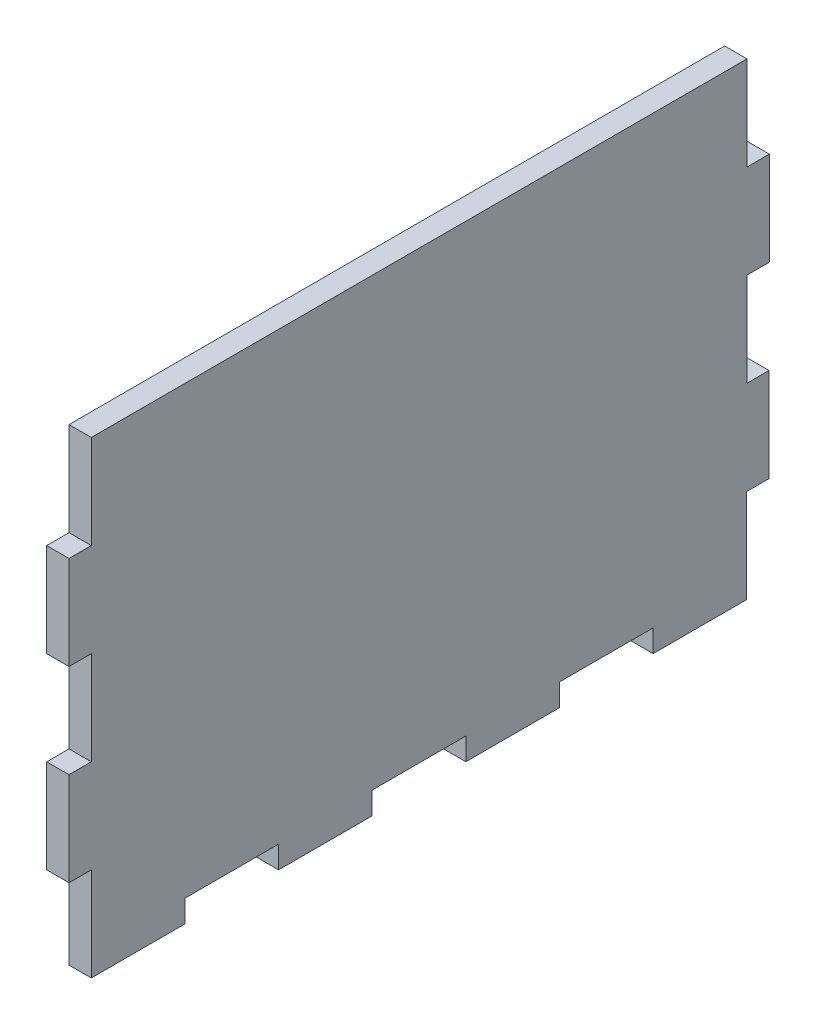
ISO-10303-21;
HEADER;
FILE_DESCRIPTION(('STEP AP214'),'2;1');
FILE_NAME('part.step','',(''),(''),'','','');
FILE_SCHEMA(('AUTOMOTIVE_DESIGN { 1 0 10303 214 1 1 1 1 }'));
ENDSEC;
DATA;
#1=APPLICATION_CONTEXT('core data for automotive mechanical design processes');
#2=APPLICATION_PROTOCOL_DEFINITION('international standard','automotive_design',2000,#1);
#3=PRODUCT_CONTEXT('',#1,'mechanical');
#4=PRODUCT('Part','Part','',(#3));
#5=PRODUCT_RELATED_PRODUCT_CATEGORY('part','',(#4));
#6=PRODUCT_DEFINITION_FORMATION('','',#4);
#7=PRODUCT_DEFINITION_CONTEXT('part definition',#1,'design');
#8=PRODUCT_DEFINITION('design','',#6,#7);
#9=PRODUCT_DEFINITION_SHAPE('','',#8);
#10=(LENGTH_UNIT() NAMED_UNIT(*) SI_UNIT(.MILLI.,.METRE.));
#11=(NAMED_UNIT(*) PLANE_ANGLE_UNIT() SI_UNIT($,.RADIAN.));
#12=(NAMED_UNIT(*) SI_UNIT($,.STERADIAN.) SOLID_ANGLE_UNIT());
#13=UNCERTAINTY_MEASURE_WITH_UNIT(LENGTH_MEASURE(1.E-05),#10,'distance_accuracy_value','');
#14=(GEOMETRIC_REPRESENTATION_CONTEXT(3) GLOBAL_UNCERTAINTY_ASSIGNED_CONTEXT((#13)) GLOBAL_UNIT_ASSIGNED_CONTEXT((#10,
#11,#12)) REPRESENTATION_CONTEXT('',''));
#15=CARTESIAN_POINT('',(0.,0.,0.));
#16=DIRECTION('',(0.,0.,1.));
#17=DIRECTION('',(1.,0.,0.));
#18=AXIS2_PLACEMENT_3D('',#15,#16,#17);
#19=CARTESIAN_POINT('',(7.62,0.,0.));
#20=DIRECTION('',(0.,0.,-1.));
#21=DIRECTION('',(-1.,0.,0.));
#22=AXIS2_PLACEMENT_3D('',#19,#20,#21);
#23=PLANE('',#22);
#24=DIRECTION('',(0.,-1.,0.));
#25=VECTOR('',#24,1.);
#26=CARTESIAN_POINT('',(0.,0.,0.));
#27=LINE('',#26,#25);
#28=CARTESIAN_POINT('',(0.,32.,0.));
#29=VERTEX_POINT('',#28);
#30=CARTESIAN_POINT('',(0.,0.,0.));
#31=VERTEX_POINT('',#30);
#32=EDGE_CURVE('E284',#29,#31,#27,.T.);
#33=ORIENTED_EDGE('',*,*,#32,.T.);
#34=DIRECTION('',(-1.,0.,0.));
#35=VECTOR('',#34,1.);
#36=CARTESIAN_POINT('',(7.62,0.,0.));
#37=LINE('',#36,#35);
#38=CARTESIAN_POINT('',(7.62,0.,0.));
#39=VERTEX_POINT('',#38);
#40=EDGE_CURVE('E11',#39,#31,#37,.T.);
#41=ORIENTED_EDGE('',*,*,#40,.F.);
#42=DIRECTION('',(0.,-1.,0.));
#43=VECTOR('',#42,1.);
#44=CARTESIAN_POINT('',(7.62,0.,0.));
#45=LINE('',#44,#43);
#46=CARTESIAN_POINT('',(7.62,32.,0.));
#47=VERTEX_POINT('',#46);
#48=EDGE_CURVE('E378',#47,#39,#45,.T.);
#49=ORIENTED_EDGE('',*,*,#48,.F.);
#50=DIRECTION('',(-1.,0.,0.));
#51=VECTOR('',#50,1.);
#52=CARTESIAN_POINT('',(7.62,32.,0.));
#53=LINE('',#52,#51);
#54=EDGE_CURVE('E280',#47,#29,#53,.T.);
#55=ORIENTED_EDGE('',*,*,#54,.T.);
#56=EDGE_LOOP('',(#33,#41,#49,#55));
#57=FACE_BOUND('',#56,.T.);
#58=ADVANCED_FACE('F39',(#57),#23,.F.);
#59=CARTESIAN_POINT('',(7.62,0.,0.));
#60=DIRECTION('',(0.,1.,0.));
#61=DIRECTION('',(0.,0.,1.));
#62=AXIS2_PLACEMENT_3D('',#59,#60,#61);
#63=PLANE('',#62);
#64=DIRECTION('',(0.,0.,-1.));
#65=VECTOR('',#64,1.);
#66=CARTESIAN_POINT('',(0.,0.,0.));
#67=LINE('',#66,#65);
#68=CARTESIAN_POINT('',(0.,0.,-32.004));
#69=VERTEX_POINT('',#68);
#70=EDGE_CURVE('E288',#31,#69,#67,.T.);
#71=ORIENTED_EDGE('',*,*,#70,.T.);
#72=DIRECTION('',(-1.,0.,0.));
#73=VECTOR('',#72,1.);
#74=CARTESIAN_POINT('',(7.62,0.,-32.004));
#75=LINE('',#74,#73);
#76=CARTESIAN_POINT('',(7.62,0.,-32.004));
#77=VERTEX_POINT('',#76);
#78=EDGE_CURVE('E48',#77,#69,#75,.T.);
#79=ORIENTED_EDGE('',*,*,#78,.F.);
#80=DIRECTION('',(0.,0.,-1.));
#81=VECTOR('',#80,1.);
#82=CARTESIAN_POINT('',(7.62,0.,0.));
#83=LINE('',#82,#81);
#84=EDGE_CURVE('E171',#39,#77,#83,.T.);
#85=ORIENTED_EDGE('',*,*,#84,.F.);
#86=ORIENTED_EDGE('',*,*,#40,.T.);
#87=EDGE_LOOP('',(#71,#79,#85,#86));
#88=FACE_BOUND('',#87,.T.);
#89=ADVANCED_FACE('F612',(#88),#63,.F.);
#90=CARTESIAN_POINT('',(7.62,0.,-32.004));
#91=DIRECTION('',(0.,0.,1.));
#92=DIRECTION('',(1.,0.,0.));
#93=AXIS2_PLACEMENT_3D('',#90,#91,#92);
#94=PLANE('',#93);
#95=DIRECTION('',(0.,1.,0.));
#96=VECTOR('',#95,1.);
#97=CARTESIAN_POINT('',(0.,0.,-32.004));
#98=LINE('',#97,#96);
#99=CARTESIAN_POINT('',(0.,7.62,-32.004));
#100=VERTEX_POINT('',#99);
#101=EDGE_CURVE('E291',#69,#100,#98,.T.);
#102=ORIENTED_EDGE('',*,*,#101,.T.);
#103=DIRECTION('',(-1.,0.,0.));
#104=VECTOR('',#103,1.);
#105=CARTESIAN_POINT('',(7.62,7.62,-32.004));
#106=LINE('',#105,#104);
#107=CARTESIAN_POINT('',(7.62,7.62,-32.004));
#108=VERTEX_POINT('',#107);
#109=EDGE_CURVE('E485',#108,#100,#106,.T.);
#110=ORIENTED_EDGE('',*,*,#109,.F.);
#111=DIRECTION('',(0.,1.,0.));
#112=VECTOR('',#111,1.);
#113=CARTESIAN_POINT('',(7.62,0.,-32.004));
#114=LINE('',#113,#112);
#115=EDGE_CURVE('E495',#77,#108,#114,.T.);
#116=ORIENTED_EDGE('',*,*,#115,.F.);
#117=ORIENTED_EDGE('',*,*,#78,.T.);
#118=EDGE_LOOP('',(#102,#110,#116,#117));
#119=FACE_BOUND('',#118,.T.);
#120=ADVANCED_FACE('F493',(#119),#94,.F.);
#121=CARTESIAN_POINT('',(7.62,7.62,-32.004));
#122=DIRECTION('',(0.,1.,0.));
#123=DIRECTION('',(0.,0.,1.));
#124=AXIS2_PLACEMENT_3D('',#121,#122,#123);
#125=PLANE('',#124);
#126=DIRECTION('',(0.,0.,-1.));
#127=VECTOR('',#126,1.);
#128=CARTESIAN_POINT('',(0.,7.62,-32.004));
#129=LINE('',#128,#127);
#130=CARTESIAN_POINT('',(0.,7.62,-64.008));
#131=VERTEX_POINT('',#130);
#132=EDGE_CURVE('E294',#100,#131,#129,.T.);
#133=ORIENTED_EDGE('',*,*,#132,.T.);
#134=DIRECTION('',(-1.,0.,0.));
#135=VECTOR('',#134,1.);
#136=CARTESIAN_POINT('',(7.62,7.62,-64.008));
#137=LINE('',#136,#135);
#138=CARTESIAN_POINT('',(7.62,7.62,-64.008));
#139=VERTEX_POINT('',#138);
#140=EDGE_CURVE('E481',#139,#131,#137,.T.);
#141=ORIENTED_EDGE('',*,*,#140,.F.);
#142=DIRECTION('',(0.,0.,-1.));
#143=VECTOR('',#142,1.);
#144=CARTESIAN_POINT('',(7.62,7.62,-32.004));
#145=LINE('',#144,#143);
#146=EDGE_CURVE('E514',#108,#139,#145,.T.);
#147=ORIENTED_EDGE('',*,*,#146,.F.);
#148=ORIENTED_EDGE('',*,*,#109,.T.);
#149=EDGE_LOOP('',(#133,#141,#147,#148));
#150=FACE_BOUND('',#149,.T.);
#151=ADVANCED_FACE('F504',(#150),#125,.F.);
#152=CARTESIAN_POINT('',(7.62,7.62,-64.008));
#153=DIRECTION('',(0.,0.,-1.));
#154=DIRECTION('',(-1.,0.,0.));
#155=AXIS2_PLACEMENT_3D('',#152,#153,#154);
#156=PLANE('',#155);
#157=DIRECTION('',(0.,-1.,0.));
#158=VECTOR('',#157,1.);
#159=CARTESIAN_POINT('',(0.,7.62,-64.008));
#160=LINE('',#159,#158);
#161=CARTESIAN_POINT('',(0.,0.,-64.008));
#162=VERTEX_POINT('',#161);
#163=EDGE_CURVE('E297',#131,#162,#160,.T.);
#164=ORIENTED_EDGE('',*,*,#163,.T.);
#165=DIRECTION('',(-1.,0.,0.));
#166=VECTOR('',#165,1.);
#167=CARTESIAN_POINT('',(7.62,0.,-64.008));
#168=LINE('',#167,#166);
#169=CARTESIAN_POINT('',(7.62,0.,-64.008));
#170=VERTEX_POINT('',#169);
#171=EDGE_CURVE('E477',#170,#162,#168,.T.);
#172=ORIENTED_EDGE('',*,*,#171,.F.);
#173=DIRECTION('',(0.,-1.,0.));
#174=VECTOR('',#173,1.);
#175=CARTESIAN_POINT('',(7.62,7.62,-64.008));
#176=LINE('',#175,#174);
#177=EDGE_CURVE('E510',#139,#170,#176,.T.);
#178=ORIENTED_EDGE('',*,*,#177,.F.);
#179=ORIENTED_EDGE('',*,*,#140,.T.);
#180=EDGE_LOOP('',(#164,#172,#178,#179));
#181=FACE_BOUND('',#180,.T.);
#182=ADVANCED_FACE('F508',(#181),#156,.F.);
#183=CARTESIAN_POINT('',(7.62,0.,-64.008));
#184=DIRECTION('',(0.,1.,0.));
#185=DIRECTION('',(0.,0.,1.));
#186=AXIS2_PLACEMENT_3D('',#183,#184,#185);
#187=PLANE('',#186);
#188=DIRECTION('',(0.,0.,-1.));
#189=VECTOR('',#188,1.);
#190=CARTESIAN_POINT('',(0.,0.,-64.008));
#191=LINE('',#190,#189);
#192=CARTESIAN_POINT('',(0.,0.,-96.012));
#193=VERTEX_POINT('',#192);
#194=EDGE_CURVE('E300',#162,#193,#191,.T.);
#195=ORIENTED_EDGE('',*,*,#194,.T.);
#196=DIRECTION('',(-1.,0.,0.));
#197=VECTOR('',#196,1.);
#198=CARTESIAN_POINT('',(7.62,0.,-96.012));
#199=LINE('',#198,#197);
#200=CARTESIAN_POINT('',(7.62,0.,-96.012));
#201=VERTEX_POINT('',#200);
#202=EDGE_CURVE('E473',#201,#193,#199,.T.);
#203=ORIENTED_EDGE('',*,*,#202,.F.);
#204=DIRECTION('',(0.,0.,-1.));
#205=VECTOR('',#204,1.);
#206=CARTESIAN_POINT('',(7.62,0.,-64.008));
#207=LINE('',#206,#205);
#208=EDGE_CURVE('E513',#170,#201,#207,.T.);
#209=ORIENTED_EDGE('',*,*,#208,.F.);
#210=ORIENTED_EDGE('',*,*,#171,.T.);
#211=EDGE_LOOP('',(#195,#203,#209,#210));
#212=FACE_BOUND('',#211,.T.);
#213=ADVANCED_FACE('F625',(#212),#187,.F.);
#214=CARTESIAN_POINT('',(7.62,0.,-96.012));
#215=DIRECTION('',(0.,0.,1.));
#216=DIRECTION('',(1.,0.,0.));
#217=AXIS2_PLACEMENT_3D('',#214,#215,#216);
#218=PLANE('',#217);
#219=DIRECTION('',(0.,1.,0.));
#220=VECTOR('',#219,1.);
#221=CARTESIAN_POINT('',(0.,0.,-96.012));
#222=LINE('',#221,#220);
#223=CARTESIAN_POINT('',(0.,7.62,-96.012));
#224=VERTEX_POINT('',#223);
#225=EDGE_CURVE('E303',#193,#224,#222,.T.);
#226=ORIENTED_EDGE('',*,*,#225,.T.);
#227=DIRECTION('',(-1.,0.,0.));
#228=VECTOR('',#227,1.);
#229=CARTESIAN_POINT('',(7.62,7.62,-96.012));
#230=LINE('',#229,#228);
#231=CARTESIAN_POINT('',(7.62,7.62,-96.012));
#232=VERTEX_POINT('',#231);
#233=EDGE_CURVE('E469',#232,#224,#230,.T.);
#234=ORIENTED_EDGE('',*,*,#233,.F.);
#235=DIRECTION('',(0.,1.,0.));
#236=VECTOR('',#235,1.);
#237=CARTESIAN_POINT('',(7.62,0.,-96.012));
#238=LINE('',#237,#236);
#239=EDGE_CURVE('E518',#201,#232,#238,.T.);
#240=ORIENTED_EDGE('',*,*,#239,.F.);
#241=ORIENTED_EDGE('',*,*,#202,.T.);
#242=EDGE_LOOP('',(#226,#234,#240,#241));
#243=FACE_BOUND('',#242,.T.);
#244=ADVANCED_FACE('F628',(#243),#218,.F.);
#245=CARTESIAN_POINT('',(7.62,7.62,-96.012));
#246=DIRECTION('',(0.,1.,0.));
#247=DIRECTION('',(0.,0.,1.));
#248=AXIS2_PLACEMENT_3D('',#245,#246,#247);
#249=PLANE('',#248);
#250=DIRECTION('',(0.,0.,-1.));
#251=VECTOR('',#250,1.);
#252=CARTESIAN_POINT('',(0.,7.62,-96.012));
#253=LINE('',#252,#251);
#254=CARTESIAN_POINT('',(0.,7.62,-128.016));
#255=VERTEX_POINT('',#254);
#256=EDGE_CURVE('E306',#224,#255,#253,.T.);
#257=ORIENTED_EDGE('',*,*,#256,.T.);
#258=DIRECTION('',(-1.,0.,0.));
#259=VECTOR('',#258,1.);
#260=CARTESIAN_POINT('',(7.62,7.62,-128.016));
#261=LINE('',#260,#259);
#262=CARTESIAN_POINT('',(7.62,7.62,-128.016));
#263=VERTEX_POINT('',#262);
#264=EDGE_CURVE('E465',#263,#255,#261,.T.);
#265=ORIENTED_EDGE('',*,*,#264,.F.);
#266=DIRECTION('',(0.,0.,-1.));
#267=VECTOR('',#266,1.);
#268=CARTESIAN_POINT('',(7.62,7.62,-96.012));
#269=LINE('',#268,#267);
#270=EDGE_CURVE('E525',#232,#263,#269,.T.);
#271=ORIENTED_EDGE('',*,*,#270,.F.);
#272=ORIENTED_EDGE('',*,*,#233,.T.);
#273=EDGE_LOOP('',(#257,#265,#271,#272));
#274=FACE_BOUND('',#273,.T.);
#275=ADVANCED_FACE('F632',(#274),#249,.F.);
#276=CARTESIAN_POINT('',(7.62,7.62,-128.016));
#277=DIRECTION('',(0.,0.,-1.));
#278=DIRECTION('',(-1.,0.,0.));
#279=AXIS2_PLACEMENT_3D('',#276,#277,#278);
#280=PLANE('',#279);
#281=DIRECTION('',(0.,-1.,0.));
#282=VECTOR('',#281,1.);
#283=CARTESIAN_POINT('',(0.,7.62,-128.016));
#284=LINE('',#283,#282);
#285=CARTESIAN_POINT('',(0.,0.,-128.016));
#286=VERTEX_POINT('',#285);
#287=EDGE_CURVE('E309',#255,#286,#284,.T.);
#288=ORIENTED_EDGE('',*,*,#287,.T.);
#289=DIRECTION('',(-1.,0.,0.));
#290=VECTOR('',#289,1.);
#291=CARTESIAN_POINT('',(7.62,0.,-128.016));
#292=LINE('',#291,#290);
#293=CARTESIAN_POINT('',(7.62,0.,-128.016));
#294=VERTEX_POINT('',#293);
#295=EDGE_CURVE('E461',#294,#286,#292,.T.);
#296=ORIENTED_EDGE('',*,*,#295,.F.);
#297=DIRECTION('',(0.,-1.,0.));
#298=VECTOR('',#297,1.);
#299=CARTESIAN_POINT('',(7.62,7.62,-128.016));
#300=LINE('',#299,#298);
#301=EDGE_CURVE('E528',#263,#294,#300,.T.);
#302=ORIENTED_EDGE('',*,*,#301,.F.);
#303=ORIENTED_EDGE('',*,*,#264,.T.);
#304=EDGE_LOOP('',(#288,#296,#302,#303));
#305=FACE_BOUND('',#304,.T.);
#306=ADVANCED_FACE('F636',(#305),#280,.F.);
#307=CARTESIAN_POINT('',(7.62,0.,-128.016));
#308=DIRECTION('',(0.,1.,0.));
#309=DIRECTION('',(0.,0.,1.));
#310=AXIS2_PLACEMENT_3D('',#307,#308,#309);
#311=PLANE('',#310);
#312=DIRECTION('',(0.,0.,-1.));
#313=VECTOR('',#312,1.);
#314=CARTESIAN_POINT('',(0.,0.,-128.016));
#315=LINE('',#314,#313);
#316=CARTESIAN_POINT('',(0.,0.,-160.02));
#317=VERTEX_POINT('',#316);
#318=EDGE_CURVE('E312',#286,#317,#315,.T.);
#319=ORIENTED_EDGE('',*,*,#318,.T.);
#320=DIRECTION('',(-1.,0.,0.));
#321=VECTOR('',#320,1.);
#322=CARTESIAN_POINT('',(7.62,0.,-160.02));
#323=LINE('',#322,#321);
#324=CARTESIAN_POINT('',(7.62,0.,-160.02));
#325=VERTEX_POINT('',#324);
#326=EDGE_CURVE('E457',#325,#317,#323,.T.);
#327=ORIENTED_EDGE('',*,*,#326,.F.);
#328=DIRECTION('',(0.,0.,-1.));
#329=VECTOR('',#328,1.);
#330=CARTESIAN_POINT('',(7.62,0.,-128.016));
#331=LINE('',#330,#329);
#332=EDGE_CURVE('E531',#294,#325,#331,.T.);
#333=ORIENTED_EDGE('',*,*,#332,.F.);
#334=ORIENTED_EDGE('',*,*,#295,.T.);
#335=EDGE_LOOP('',(#319,#327,#333,#334));
#336=FACE_BOUND('',#335,.T.);
#337=ADVANCED_FACE('F640',(#336),#311,.F.);
#338=CARTESIAN_POINT('',(7.62,0.,-160.02));
#339=DIRECTION('',(0.,0.,1.));
#340=DIRECTION('',(1.,0.,0.));
#341=AXIS2_PLACEMENT_3D('',#338,#339,#340);
#342=PLANE('',#341);
#343=DIRECTION('',(0.,1.,0.));
#344=VECTOR('',#343,1.);
#345=CARTESIAN_POINT('',(0.,0.,-160.02));
#346=LINE('',#345,#344);
#347=CARTESIAN_POINT('',(0.,7.62,-160.02));
#348=VERTEX_POINT('',#347);
#349=EDGE_CURVE('E315',#317,#348,#346,.T.);
#350=ORIENTED_EDGE('',*,*,#349,.T.);
#351=DIRECTION('',(-1.,0.,0.));
#352=VECTOR('',#351,1.);
#353=CARTESIAN_POINT('',(7.62,7.62,-160.02));
#354=LINE('',#353,#352);
#355=CARTESIAN_POINT('',(7.62,7.62,-160.02));
#356=VERTEX_POINT('',#355);
#357=EDGE_CURVE('E453',#356,#348,#354,.T.);
#358=ORIENTED_EDGE('',*,*,#357,.F.);
#359=DIRECTION('',(0.,1.,0.));
#360=VECTOR('',#359,1.);
#361=CARTESIAN_POINT('',(7.62,0.,-160.02));
#362=LINE('',#361,#360);
#363=EDGE_CURVE('E534',#325,#356,#362,.T.);
#364=ORIENTED_EDGE('',*,*,#363,.F.);
#365=ORIENTED_EDGE('',*,*,#326,.T.);
#366=EDGE_LOOP('',(#350,#358,#364,#365));
#367=FACE_BOUND('',#366,.T.);
#368=ADVANCED_FACE('F644',(#367),#342,.F.);
#369=CARTESIAN_POINT('',(7.62,7.62,-160.02));
#370=DIRECTION('',(0.,1.,0.));
#371=DIRECTION('',(0.,0.,1.));
#372=AXIS2_PLACEMENT_3D('',#369,#370,#371);
#373=PLANE('',#372);
#374=DIRECTION('',(0.,0.,-1.));
#375=VECTOR('',#374,1.);
#376=CARTESIAN_POINT('',(0.,7.62,-160.02));
#377=LINE('',#376,#375);
#378=CARTESIAN_POINT('',(0.,7.62,-192.024));
#379=VERTEX_POINT('',#378);
#380=EDGE_CURVE('E318',#348,#379,#377,.T.);
#381=ORIENTED_EDGE('',*,*,#380,.T.);
#382=DIRECTION('',(-1.,0.,0.));
#383=VECTOR('',#382,1.);
#384=CARTESIAN_POINT('',(7.62,7.62,-192.024));
#385=LINE('',#384,#383);
#386=CARTESIAN_POINT('',(7.62,7.62,-192.024));
#387=VERTEX_POINT('',#386);
#388=EDGE_CURVE('E449',#387,#379,#385,.T.);
#389=ORIENTED_EDGE('',*,*,#388,.F.);
#390=DIRECTION('',(0.,0.,-1.));
#391=VECTOR('',#390,1.);
#392=CARTESIAN_POINT('',(7.62,7.62,-160.02));
#393=LINE('',#392,#391);
#394=EDGE_CURVE('E537',#356,#387,#393,.T.);
#395=ORIENTED_EDGE('',*,*,#394,.F.);
#396=ORIENTED_EDGE('',*,*,#357,.T.);
#397=EDGE_LOOP('',(#381,#389,#395,#396));
#398=FACE_BOUND('',#397,.T.);
#399=ADVANCED_FACE('F648',(#398),#373,.F.);
#400=CARTESIAN_POINT('',(7.62,7.62,-192.024));
#401=DIRECTION('',(0.,0.,-1.));
#402=DIRECTION('',(-1.,0.,0.));
#403=AXIS2_PLACEMENT_3D('',#400,#401,#402);
#404=PLANE('',#403);
#405=DIRECTION('',(0.,-1.,0.));
#406=VECTOR('',#405,1.);
#407=CARTESIAN_POINT('',(0.,7.62,-192.024));
#408=LINE('',#407,#406);
#409=CARTESIAN_POINT('',(0.,0.,-192.024));
#410=VERTEX_POINT('',#409);
#411=EDGE_CURVE('E321',#379,#410,#408,.T.);
#412=ORIENTED_EDGE('',*,*,#411,.T.);
#413=DIRECTION('',(-1.,0.,0.));
#414=VECTOR('',#413,1.);
#415=CARTESIAN_POINT('',(7.62,0.,-192.024));
#416=LINE('',#415,#414);
#417=CARTESIAN_POINT('',(7.62,0.,-192.024));
#418=VERTEX_POINT('',#417);
#419=EDGE_CURVE('E445',#418,#410,#416,.T.);
#420=ORIENTED_EDGE('',*,*,#419,.F.);
#421=DIRECTION('',(0.,-1.,0.));
#422=VECTOR('',#421,1.);
#423=CARTESIAN_POINT('',(7.62,7.62,-192.024));
#424=LINE('',#423,#422);
#425=EDGE_CURVE('E540',#387,#418,#424,.T.);
#426=ORIENTED_EDGE('',*,*,#425,.F.);
#427=ORIENTED_EDGE('',*,*,#388,.T.);
#428=EDGE_LOOP('',(#412,#420,#426,#427));
#429=FACE_BOUND('',#428,.T.);
#430=ADVANCED_FACE('F652',(#429),#404,.F.);
#431=CARTESIAN_POINT('',(7.62,0.,-192.024));
#432=DIRECTION('',(0.,1.,0.));
#433=DIRECTION('',(0.,0.,1.));
#434=AXIS2_PLACEMENT_3D('',#431,#432,#433);
#435=PLANE('',#434);
#436=DIRECTION('',(0.,0.,-1.));
#437=VECTOR('',#436,1.);
#438=CARTESIAN_POINT('',(0.,0.,-192.024));
#439=LINE('',#438,#437);
#440=CARTESIAN_POINT('',(0.,0.,-224.028));
#441=VERTEX_POINT('',#440);
#442=EDGE_CURVE('E324',#410,#441,#439,.T.);
#443=ORIENTED_EDGE('',*,*,#442,.T.);
#444=DIRECTION('',(-1.,0.,0.));
#445=VECTOR('',#444,1.);
#446=CARTESIAN_POINT('',(7.62,0.,-224.028));
#447=LINE('',#446,#445);
#448=CARTESIAN_POINT('',(7.62,0.,-224.028));
#449=VERTEX_POINT('',#448);
#450=EDGE_CURVE('E441',#449,#441,#447,.T.);
#451=ORIENTED_EDGE('',*,*,#450,.F.);
#452=DIRECTION('',(0.,0.,-1.));
#453=VECTOR('',#452,1.);
#454=CARTESIAN_POINT('',(7.62,0.,-192.024));
#455=LINE('',#454,#453);
#456=EDGE_CURVE('E543',#418,#449,#455,.T.);
#457=ORIENTED_EDGE('',*,*,#456,.F.);
#458=ORIENTED_EDGE('',*,*,#419,.T.);
#459=EDGE_LOOP('',(#443,#451,#457,#458));
#460=FACE_BOUND('',#459,.T.);
#461=ADVANCED_FACE('F656',(#460),#435,.F.);
#462=CARTESIAN_POINT('',(7.62,0.,-224.028));
#463=DIRECTION('',(0.,0.,1.));
#464=DIRECTION('',(1.,0.,0.));
#465=AXIS2_PLACEMENT_3D('',#462,#463,#464);
#466=PLANE('',#465);
#467=DIRECTION('',(0.,1.,0.));
#468=VECTOR('',#467,1.);
#469=CARTESIAN_POINT('',(0.,0.,-224.028));
#470=LINE('',#469,#468);
#471=CARTESIAN_POINT('',(0.,32.,-224.028));
#472=VERTEX_POINT('',#471);
#473=EDGE_CURVE('E327',#441,#472,#470,.T.);
#474=ORIENTED_EDGE('',*,*,#473,.T.);
#475=DIRECTION('',(-1.,0.,0.));
#476=VECTOR('',#475,1.);
#477=CARTESIAN_POINT('',(7.62,32.,-224.028));
#478=LINE('',#477,#476);
#479=CARTESIAN_POINT('',(7.62,32.,-224.028));
#480=VERTEX_POINT('',#479);
#481=EDGE_CURVE('E437',#480,#472,#478,.T.);
#482=ORIENTED_EDGE('',*,*,#481,.F.);
#483=DIRECTION('',(0.,1.,0.));
#484=VECTOR('',#483,1.);
#485=CARTESIAN_POINT('',(7.62,0.,-224.028));
#486=LINE('',#485,#484);
#487=EDGE_CURVE('E546',#449,#480,#486,.T.);
#488=ORIENTED_EDGE('',*,*,#487,.F.);
#489=ORIENTED_EDGE('',*,*,#450,.T.);
#490=EDGE_LOOP('',(#474,#482,#488,#489));
#491=FACE_BOUND('',#490,.T.);
#492=ADVANCED_FACE('F660',(#491),#466,.F.);
#493=CARTESIAN_POINT('',(7.62,32.,-224.028));
#494=DIRECTION('',(0.,1.,0.));
#495=DIRECTION('',(0.,0.,1.));
#496=AXIS2_PLACEMENT_3D('',#493,#494,#495);
#497=PLANE('',#496);
#498=DIRECTION('',(0.,0.,-1.));
#499=VECTOR('',#498,1.);
#500=CARTESIAN_POINT('',(0.,32.,-224.028));
#501=LINE('',#500,#499);
#502=CARTESIAN_POINT('',(0.,32.,-231.648));
#503=VERTEX_POINT('',#502);
#504=EDGE_CURVE('E330',#472,#503,#501,.T.);
#505=ORIENTED_EDGE('',*,*,#504,.T.);
#506=DIRECTION('',(-1.,0.,0.));
#507=VECTOR('',#506,1.);
#508=CARTESIAN_POINT('',(7.62,32.,-231.648));
#509=LINE('',#508,#507);
#510=CARTESIAN_POINT('',(7.62,32.,-231.648));
#511=VERTEX_POINT('',#510);
#512=EDGE_CURVE('E433',#511,#503,#509,.T.);
#513=ORIENTED_EDGE('',*,*,#512,.F.);
#514=DIRECTION('',(0.,0.,-1.));
#515=VECTOR('',#514,1.);
#516=CARTESIAN_POINT('',(7.62,32.,-224.028));
#517=LINE('',#516,#515);
#518=EDGE_CURVE('E549',#480,#511,#517,.T.);
#519=ORIENTED_EDGE('',*,*,#518,.F.);
#520=ORIENTED_EDGE('',*,*,#481,.T.);
#521=EDGE_LOOP('',(#505,#513,#519,#520));
#522=FACE_BOUND('',#521,.T.);
#523=ADVANCED_FACE('F664',(#522),#497,.F.);
#524=CARTESIAN_POINT('',(7.62,32.,-231.648));
#525=DIRECTION('',(0.,0.,1.));
#526=DIRECTION('',(1.,0.,0.));
#527=AXIS2_PLACEMENT_3D('',#524,#525,#526);
#528=PLANE('',#527);
#529=DIRECTION('',(0.,1.,0.));
#530=VECTOR('',#529,1.);
#531=CARTESIAN_POINT('',(0.,32.,-231.648));
#532=LINE('',#531,#530);
#533=CARTESIAN_POINT('',(0.,64.,-231.648));
#534=VERTEX_POINT('',#533);
#535=EDGE_CURVE('E333',#503,#534,#532,.T.);
#536=ORIENTED_EDGE('',*,*,#535,.T.);
#537=DIRECTION('',(-1.,0.,0.));
#538=VECTOR('',#537,1.);
#539=CARTESIAN_POINT('',(7.62,64.,-231.648));
#540=LINE('',#539,#538);
#541=CARTESIAN_POINT('',(7.62,64.,-231.648));
#542=VERTEX_POINT('',#541);
#543=EDGE_CURVE('E429',#542,#534,#540,.T.);
#544=ORIENTED_EDGE('',*,*,#543,.F.);
#545=DIRECTION('',(0.,1.,0.));
#546=VECTOR('',#545,1.);
#547=CARTESIAN_POINT('',(7.62,32.,-231.648));
#548=LINE('',#547,#546);
#549=EDGE_CURVE('E552',#511,#542,#548,.T.);
#550=ORIENTED_EDGE('',*,*,#549,.F.);
#551=ORIENTED_EDGE('',*,*,#512,.T.);
#552=EDGE_LOOP('',(#536,#544,#550,#551));
#553=FACE_BOUND('',#552,.T.);
#554=ADVANCED_FACE('F668',(#553),#528,.F.);
#555=CARTESIAN_POINT('',(7.62,64.,-231.648));
#556=DIRECTION('',(0.,-1.,0.));
#557=DIRECTION('',(0.,0.,-1.));
#558=AXIS2_PLACEMENT_3D('',#555,#556,#557);
#559=PLANE('',#558);
#560=DIRECTION('',(0.,0.,1.));
#561=VECTOR('',#560,1.);
#562=CARTESIAN_POINT('',(0.,64.,-231.648));
#563=LINE('',#562,#561);
#564=CARTESIAN_POINT('',(0.,64.,-224.120706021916));
#565=VERTEX_POINT('',#564);
#566=EDGE_CURVE('E336',#534,#565,#563,.T.);
#567=ORIENTED_EDGE('',*,*,#566,.T.);
#568=DIRECTION('',(-1.,0.,0.));
#569=VECTOR('',#568,1.);
#570=CARTESIAN_POINT('',(7.62,64.,-224.120706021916));
#571=LINE('',#570,#569);
#572=CARTESIAN_POINT('',(7.62,64.,-224.120706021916));
#573=VERTEX_POINT('',#572);
#574=EDGE_CURVE('E425',#573,#565,#571,.T.);
#575=ORIENTED_EDGE('',*,*,#574,.F.);
#576=DIRECTION('',(0.,0.,1.));
#577=VECTOR('',#576,1.);
#578=CARTESIAN_POINT('',(7.62,64.,-231.648));
#579=LINE('',#578,#577);
#580=EDGE_CURVE('E555',#542,#573,#579,.T.);
#581=ORIENTED_EDGE('',*,*,#580,.F.);
#582=ORIENTED_EDGE('',*,*,#543,.T.);
#583=EDGE_LOOP('',(#567,#575,#581,#582));
#584=FACE_BOUND('',#583,.T.);
#585=ADVANCED_FACE('F672',(#584),#559,.F.);
#586=CARTESIAN_POINT('',(7.62,64.,-224.120706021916));
#587=DIRECTION('',(0.,0.,1.));
#588=DIRECTION('',(1.,0.,0.));
#589=AXIS2_PLACEMENT_3D('',#586,#587,#588);
#590=PLANE('',#589);
#591=DIRECTION('',(0.,1.,0.));
#592=VECTOR('',#591,1.);
#593=CARTESIAN_POINT('',(0.,64.,-224.120706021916));
#594=LINE('',#593,#592);
#595=CARTESIAN_POINT('',(0.,96.,-224.120706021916));
#596=VERTEX_POINT('',#595);
#597=EDGE_CURVE('E339',#565,#596,#594,.T.);
#598=ORIENTED_EDGE('',*,*,#597,.T.);
#599=DIRECTION('',(-1.,0.,0.));
#600=VECTOR('',#599,1.);
#601=CARTESIAN_POINT('',(7.62,96.,-224.120706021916));
#602=LINE('',#601,#600);
#603=CARTESIAN_POINT('',(7.62,96.,-224.120706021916));
#604=VERTEX_POINT('',#603);
#605=EDGE_CURVE('E421',#604,#596,#602,.T.);
#606=ORIENTED_EDGE('',*,*,#605,.F.);
#607=DIRECTION('',(0.,1.,0.));
#608=VECTOR('',#607,1.);
#609=CARTESIAN_POINT('',(7.62,64.,-224.120706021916));
#610=LINE('',#609,#608);
#611=EDGE_CURVE('E558',#573,#604,#610,.T.);
#612=ORIENTED_EDGE('',*,*,#611,.F.);
#613=ORIENTED_EDGE('',*,*,#574,.T.);
#614=EDGE_LOOP('',(#598,#606,#612,#613));
#615=FACE_BOUND('',#614,.T.);
#616=ADVANCED_FACE('F676',(#615),#590,.F.);
#617=CARTESIAN_POINT('',(7.62,96.,-224.120706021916));
#618=DIRECTION('',(0.,1.,0.));
#619=DIRECTION('',(0.,0.,1.));
#620=AXIS2_PLACEMENT_3D('',#617,#618,#619);
#621=PLANE('',#620);
#622=DIRECTION('',(0.,0.,-1.));
#623=VECTOR('',#622,1.);
#624=CARTESIAN_POINT('',(0.,96.,-224.120706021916));
#625=LINE('',#624,#623);
#626=CARTESIAN_POINT('',(0.,96.,-231.740706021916));
#627=VERTEX_POINT('',#626);
#628=EDGE_CURVE('E342',#596,#627,#625,.T.);
#629=ORIENTED_EDGE('',*,*,#628,.T.);
#630=DIRECTION('',(-1.,0.,0.));
#631=VECTOR('',#630,1.);
#632=CARTESIAN_POINT('',(7.62,96.,-231.740706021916));
#633=LINE('',#632,#631);
#634=CARTESIAN_POINT('',(7.62,96.,-231.740706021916));
#635=VERTEX_POINT('',#634);
#636=EDGE_CURVE('E417',#635,#627,#633,.T.);
#637=ORIENTED_EDGE('',*,*,#636,.F.);
#638=DIRECTION('',(0.,0.,-1.));
#639=VECTOR('',#638,1.);
#640=CARTESIAN_POINT('',(7.62,96.,-224.120706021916));
#641=LINE('',#640,#639);
#642=EDGE_CURVE('E561',#604,#635,#641,.T.);
#643=ORIENTED_EDGE('',*,*,#642,.F.);
#644=ORIENTED_EDGE('',*,*,#605,.T.);
#645=EDGE_LOOP('',(#629,#637,#643,#644));
#646=FACE_BOUND('',#645,.T.);
#647=ADVANCED_FACE('F680',(#646),#621,.F.);
#648=CARTESIAN_POINT('',(7.62,96.,-231.740706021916));
#649=DIRECTION('',(0.,0.,1.));
#650=DIRECTION('',(1.,0.,0.));
#651=AXIS2_PLACEMENT_3D('',#648,#649,#650);
#652=PLANE('',#651);
#653=DIRECTION('',(0.,1.,0.));
#654=VECTOR('',#653,1.);
#655=CARTESIAN_POINT('',(0.,96.,-231.740706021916));
#656=LINE('',#655,#654);
#657=CARTESIAN_POINT('',(0.,128.,-231.740706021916));
#658=VERTEX_POINT('',#657);
#659=EDGE_CURVE('E345',#627,#658,#656,.T.);
#660=ORIENTED_EDGE('',*,*,#659,.T.);
#661=DIRECTION('',(-1.,0.,0.));
#662=VECTOR('',#661,1.);
#663=CARTESIAN_POINT('',(7.62,128.,-231.740706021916));
#664=LINE('',#663,#662);
#665=CARTESIAN_POINT('',(7.62,128.,-231.740706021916));
#666=VERTEX_POINT('',#665);
#667=EDGE_CURVE('E413',#666,#658,#664,.T.);
#668=ORIENTED_EDGE('',*,*,#667,.F.);
#669=DIRECTION('',(0.,1.,0.));
#670=VECTOR('',#669,1.);
#671=CARTESIAN_POINT('',(7.62,96.,-231.740706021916));
#672=LINE('',#671,#670);
#673=EDGE_CURVE('E564',#635,#666,#672,.T.);
#674=ORIENTED_EDGE('',*,*,#673,.F.);
#675=ORIENTED_EDGE('',*,*,#636,.T.);
#676=EDGE_LOOP('',(#660,#668,#674,#675));
#677=FACE_BOUND('',#676,.T.);
#678=ADVANCED_FACE('F684',(#677),#652,.F.);
#679=CARTESIAN_POINT('',(7.62,128.,-231.740706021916));
#680=DIRECTION('',(0.,-1.,0.));
#681=DIRECTION('',(0.,0.,-1.));
#682=AXIS2_PLACEMENT_3D('',#679,#680,#681);
#683=PLANE('',#682);
#684=DIRECTION('',(0.,0.,1.));
#685=VECTOR('',#684,1.);
#686=CARTESIAN_POINT('',(0.,128.,-231.740706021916));
#687=LINE('',#686,#685);
#688=CARTESIAN_POINT('',(0.,128.,-224.120706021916));
#689=VERTEX_POINT('',#688);
#690=EDGE_CURVE('E348',#658,#689,#687,.T.);
#691=ORIENTED_EDGE('',*,*,#690,.T.);
#692=DIRECTION('',(-1.,0.,0.));
#693=VECTOR('',#692,1.);
#694=CARTESIAN_POINT('',(7.62,128.,-224.120706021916));
#695=LINE('',#694,#693);
#696=CARTESIAN_POINT('',(7.62,128.,-224.120706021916));
#697=VERTEX_POINT('',#696);
#698=EDGE_CURVE('E409',#697,#689,#695,.T.);
#699=ORIENTED_EDGE('',*,*,#698,.F.);
#700=DIRECTION('',(0.,0.,1.));
#701=VECTOR('',#700,1.);
#702=CARTESIAN_POINT('',(7.62,128.,-231.740706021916));
#703=LINE('',#702,#701);
#704=EDGE_CURVE('E567',#666,#697,#703,.T.);
#705=ORIENTED_EDGE('',*,*,#704,.F.);
#706=ORIENTED_EDGE('',*,*,#667,.T.);
#707=EDGE_LOOP('',(#691,#699,#705,#706));
#708=FACE_BOUND('',#707,.T.);
#709=ADVANCED_FACE('F688',(#708),#683,.F.);
#710=CARTESIAN_POINT('',(7.62,128.,-224.120706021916));
#711=DIRECTION('',(0.,0.,1.));
#712=DIRECTION('',(0.,-1.,0.));
#713=AXIS2_PLACEMENT_3D('',#710,#711,#712);
#714=PLANE('',#713);
#715=DIRECTION('',(0.,1.,0.));
#716=VECTOR('',#715,1.);
#717=CARTESIAN_POINT('',(0.,128.,-224.120706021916));
#718=LINE('',#717,#716);
#719=CARTESIAN_POINT('',(0.,160.,-224.120706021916));
#720=VERTEX_POINT('',#719);
#721=EDGE_CURVE('E351',#689,#720,#718,.T.);
#722=ORIENTED_EDGE('',*,*,#721,.T.);
#723=DIRECTION('',(-1.,0.,0.));
#724=VECTOR('',#723,1.);
#725=CARTESIAN_POINT('',(7.62,160.,-224.120706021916));
#726=LINE('',#725,#724);
#727=CARTESIAN_POINT('',(7.62,160.,-224.120706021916));
#728=VERTEX_POINT('',#727);
#729=EDGE_CURVE('E405',#728,#720,#726,.T.);
#730=ORIENTED_EDGE('',*,*,#729,.F.);
#731=DIRECTION('',(0.,1.,0.));
#732=VECTOR('',#731,1.);
#733=CARTESIAN_POINT('',(7.62,128.,-224.120706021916));
#734=LINE('',#733,#732);
#735=EDGE_CURVE('E570',#697,#728,#734,.T.);
#736=ORIENTED_EDGE('',*,*,#735,.F.);
#737=ORIENTED_EDGE('',*,*,#698,.T.);
#738=EDGE_LOOP('',(#722,#730,#736,#737));
#739=FACE_BOUND('',#738,.T.);
#740=ADVANCED_FACE('F692',(#739),#714,.F.);
#741=CARTESIAN_POINT('',(7.62,160.,0.));
#742=DIRECTION('',(0.,-1.,0.));
#743=DIRECTION('',(0.,0.,-1.));
#744=AXIS2_PLACEMENT_3D('',#741,#742,#743);
#745=PLANE('',#744);
#746=DIRECTION('',(0.,0.,1.));
#747=VECTOR('',#746,1.);
#748=CARTESIAN_POINT('',(0.,160.,0.));
#749=LINE('',#748,#747);
#750=CARTESIAN_POINT('',(0.,160.,0.));
#751=VERTEX_POINT('',#750);
#752=EDGE_CURVE('E354',#720,#751,#749,.T.);
#753=ORIENTED_EDGE('',*,*,#752,.T.);
#754=DIRECTION('',(-1.,0.,0.));
#755=VECTOR('',#754,1.);
#756=CARTESIAN_POINT('',(7.62,160.,0.));
#757=LINE('',#756,#755);
#758=CARTESIAN_POINT('',(7.62,160.,0.));
#759=VERTEX_POINT('',#758);
#760=EDGE_CURVE('E401',#759,#751,#757,.T.);
#761=ORIENTED_EDGE('',*,*,#760,.F.);
#762=DIRECTION('',(0.,0.,1.));
#763=VECTOR('',#762,1.);
#764=CARTESIAN_POINT('',(7.62,160.,0.));
#765=LINE('',#764,#763);
#766=EDGE_CURVE('E573',#728,#759,#765,.T.);
#767=ORIENTED_EDGE('',*,*,#766,.F.);
#768=ORIENTED_EDGE('',*,*,#729,.T.);
#769=EDGE_LOOP('',(#753,#761,#767,#768));
#770=FACE_BOUND('',#769,.T.);
#771=ADVANCED_FACE('F696',(#770),#745,.F.);
#772=CARTESIAN_POINT('',(7.62,128.,0.));
#773=DIRECTION('',(0.,0.,-1.));
#774=DIRECTION('',(-1.,0.,0.));
#775=AXIS2_PLACEMENT_3D('',#772,#773,#774);
#776=PLANE('',#775);
#777=DIRECTION('',(0.,-1.,0.));
#778=VECTOR('',#777,1.);
#779=CARTESIAN_POINT('',(0.,128.,0.));
#780=LINE('',#779,#778);
#781=CARTESIAN_POINT('',(0.,128.,0.));
#782=VERTEX_POINT('',#781);
#783=EDGE_CURVE('E357',#751,#782,#780,.T.);
#784=ORIENTED_EDGE('',*,*,#783,.T.);
#785=DIRECTION('',(-1.,0.,0.));
#786=VECTOR('',#785,1.);
#787=CARTESIAN_POINT('',(7.62,128.,0.));
#788=LINE('',#787,#786);
#789=CARTESIAN_POINT('',(7.62,128.,0.));
#790=VERTEX_POINT('',#789);
#791=EDGE_CURVE('E397',#790,#782,#788,.T.);
#792=ORIENTED_EDGE('',*,*,#791,.F.);
#793=DIRECTION('',(0.,-1.,0.));
#794=VECTOR('',#793,1.);
#795=CARTESIAN_POINT('',(7.62,128.,0.));
#796=LINE('',#795,#794);
#797=EDGE_CURVE('E576',#759,#790,#796,.T.);
#798=ORIENTED_EDGE('',*,*,#797,.F.);
#799=ORIENTED_EDGE('',*,*,#760,.T.);
#800=EDGE_LOOP('',(#784,#792,#798,#799));
#801=FACE_BOUND('',#800,.T.);
#802=ADVANCED_FACE('F700',(#801),#776,.F.);
#803=CARTESIAN_POINT('',(7.62,128.,7.62));
#804=DIRECTION('',(0.,-1.,0.));
#805=DIRECTION('',(0.,0.,-1.));
#806=AXIS2_PLACEMENT_3D('',#803,#804,#805);
#807=PLANE('',#806);
#808=DIRECTION('',(0.,0.,1.));
#809=VECTOR('',#808,1.);
#810=CARTESIAN_POINT('',(0.,128.,7.62));
#811=LINE('',#810,#809);
#812=CARTESIAN_POINT('',(0.,128.,7.62));
#813=VERTEX_POINT('',#812);
#814=EDGE_CURVE('E360',#782,#813,#811,.T.);
#815=ORIENTED_EDGE('',*,*,#814,.T.);
#816=DIRECTION('',(-1.,0.,0.));
#817=VECTOR('',#816,1.);
#818=CARTESIAN_POINT('',(7.62,128.,7.62));
#819=LINE('',#818,#817);
#820=CARTESIAN_POINT('',(7.62,128.,7.62));
#821=VERTEX_POINT('',#820);
#822=EDGE_CURVE('E393',#821,#813,#819,.T.);
#823=ORIENTED_EDGE('',*,*,#822,.F.);
#824=DIRECTION('',(0.,0.,1.));
#825=VECTOR('',#824,1.);
#826=CARTESIAN_POINT('',(7.62,128.,7.62));
#827=LINE('',#826,#825);
#828=EDGE_CURVE('E579',#790,#821,#827,.T.);
#829=ORIENTED_EDGE('',*,*,#828,.F.);
#830=ORIENTED_EDGE('',*,*,#791,.T.);
#831=EDGE_LOOP('',(#815,#823,#829,#830));
#832=FACE_BOUND('',#831,.T.);
#833=ADVANCED_FACE('F704',(#832),#807,.F.);
#834=CARTESIAN_POINT('',(7.62,96.,7.62));
#835=DIRECTION('',(0.,0.,-1.));
#836=DIRECTION('',(0.,1.,0.));
#837=AXIS2_PLACEMENT_3D('',#834,#835,#836);
#838=PLANE('',#837);
#839=DIRECTION('',(0.,-1.,0.));
#840=VECTOR('',#839,1.);
#841=CARTESIAN_POINT('',(0.,96.,7.62));
#842=LINE('',#841,#840);
#843=CARTESIAN_POINT('',(0.,96.,7.62));
#844=VERTEX_POINT('',#843);
#845=EDGE_CURVE('E363',#813,#844,#842,.T.);
#846=ORIENTED_EDGE('',*,*,#845,.T.);
#847=DIRECTION('',(-1.,0.,0.));
#848=VECTOR('',#847,1.);
#849=CARTESIAN_POINT('',(7.62,96.,7.62));
#850=LINE('',#849,#848);
#851=CARTESIAN_POINT('',(7.62,96.,7.62));
#852=VERTEX_POINT('',#851);
#853=EDGE_CURVE('E389',#852,#844,#850,.T.);
#854=ORIENTED_EDGE('',*,*,#853,.F.);
#855=DIRECTION('',(0.,-1.,0.));
#856=VECTOR('',#855,1.);
#857=CARTESIAN_POINT('',(7.62,96.,7.62));
#858=LINE('',#857,#856);
#859=EDGE_CURVE('E582',#821,#852,#858,.T.);
#860=ORIENTED_EDGE('',*,*,#859,.F.);
#861=ORIENTED_EDGE('',*,*,#822,.T.);
#862=EDGE_LOOP('',(#846,#854,#860,#861));
#863=FACE_BOUND('',#862,.T.);
#864=ADVANCED_FACE('F708',(#863),#838,.F.);
#865=CARTESIAN_POINT('',(7.62,96.,0.));
#866=DIRECTION('',(0.,1.,0.));
#867=DIRECTION('',(0.,0.,1.));
#868=AXIS2_PLACEMENT_3D('',#865,#866,#867);
#869=PLANE('',#868);
#870=DIRECTION('',(0.,0.,-1.));
#871=VECTOR('',#870,1.);
#872=CARTESIAN_POINT('',(0.,96.,0.));
#873=LINE('',#872,#871);
#874=CARTESIAN_POINT('',(0.,96.,0.));
#875=VERTEX_POINT('',#874);
#876=EDGE_CURVE('E366',#844,#875,#873,.T.);
#877=ORIENTED_EDGE('',*,*,#876,.T.);
#878=DIRECTION('',(-1.,0.,0.));
#879=VECTOR('',#878,1.);
#880=CARTESIAN_POINT('',(7.62,96.,0.));
#881=LINE('',#880,#879);
#882=CARTESIAN_POINT('',(7.62,96.,0.));
#883=VERTEX_POINT('',#882);
#884=EDGE_CURVE('E385',#883,#875,#881,.T.);
#885=ORIENTED_EDGE('',*,*,#884,.F.);
#886=DIRECTION('',(0.,0.,-1.));
#887=VECTOR('',#886,1.);
#888=CARTESIAN_POINT('',(7.62,96.,0.));
#889=LINE('',#888,#887);
#890=EDGE_CURVE('E585',#852,#883,#889,.T.);
#891=ORIENTED_EDGE('',*,*,#890,.F.);
#892=ORIENTED_EDGE('',*,*,#853,.T.);
#893=EDGE_LOOP('',(#877,#885,#891,#892));
#894=FACE_BOUND('',#893,.T.);
#895=ADVANCED_FACE('F593',(#894),#869,.F.);
#896=CARTESIAN_POINT('',(7.62,64.,0.));
#897=DIRECTION('',(0.,0.,-1.));
#898=DIRECTION('',(-1.,0.,0.));
#899=AXIS2_PLACEMENT_3D('',#896,#897,#898);
#900=PLANE('',#899);
#901=DIRECTION('',(0.,-1.,0.));
#902=VECTOR('',#901,1.);
#903=CARTESIAN_POINT('',(0.,64.,0.));
#904=LINE('',#903,#902);
#905=CARTESIAN_POINT('',(0.,64.,0.));
#906=VERTEX_POINT('',#905);
#907=EDGE_CURVE('E369',#875,#906,#904,.T.);
#908=ORIENTED_EDGE('',*,*,#907,.T.);
#909=DIRECTION('',(-1.,0.,0.));
#910=VECTOR('',#909,1.);
#911=CARTESIAN_POINT('',(7.62,64.,0.));
#912=LINE('',#911,#910);
#913=CARTESIAN_POINT('',(7.62,64.,0.));
#914=VERTEX_POINT('',#913);
#915=EDGE_CURVE('E273',#914,#906,#912,.T.);
#916=ORIENTED_EDGE('',*,*,#915,.F.);
#917=DIRECTION('',(0.,-1.,0.));
#918=VECTOR('',#917,1.);
#919=CARTESIAN_POINT('',(7.62,64.,0.));
#920=LINE('',#919,#918);
#921=EDGE_CURVE('E262',#883,#914,#920,.T.);
#922=ORIENTED_EDGE('',*,*,#921,.F.);
#923=ORIENTED_EDGE('',*,*,#884,.T.);
#924=EDGE_LOOP('',(#908,#916,#922,#923));
#925=FACE_BOUND('',#924,.T.);
#926=ADVANCED_FACE('F597',(#925),#900,.F.);
#927=CARTESIAN_POINT('',(7.62,64.,7.62));
#928=DIRECTION('',(0.,-1.,0.));
#929=DIRECTION('',(0.,0.,-1.));
#930=AXIS2_PLACEMENT_3D('',#927,#928,#929);
#931=PLANE('',#930);
#932=DIRECTION('',(0.,0.,1.));
#933=VECTOR('',#932,1.);
#934=CARTESIAN_POINT('',(0.,64.,7.62));
#935=LINE('',#934,#933);
#936=CARTESIAN_POINT('',(0.,64.,7.62));
#937=VERTEX_POINT('',#936);
#938=EDGE_CURVE('E271',#906,#937,#935,.T.);
#939=ORIENTED_EDGE('',*,*,#938,.T.);
#940=DIRECTION('',(-1.,0.,0.));
#941=VECTOR('',#940,1.);
#942=CARTESIAN_POINT('',(7.62,64.,7.62));
#943=LINE('',#942,#941);
#944=CARTESIAN_POINT('',(7.62,64.,7.62));
#945=VERTEX_POINT('',#944);
#946=EDGE_CURVE('E268',#945,#937,#943,.T.);
#947=ORIENTED_EDGE('',*,*,#946,.F.);
#948=DIRECTION('',(0.,0.,1.));
#949=VECTOR('',#948,1.);
#950=CARTESIAN_POINT('',(7.62,64.,7.62));
#951=LINE('',#950,#949);
#952=EDGE_CURVE('E256',#914,#945,#951,.T.);
#953=ORIENTED_EDGE('',*,*,#952,.F.);
#954=ORIENTED_EDGE('',*,*,#915,.T.);
#955=EDGE_LOOP('',(#939,#947,#953,#954));
#956=FACE_BOUND('',#955,.T.);
#957=ADVANCED_FACE('F269',(#956),#931,.F.);
#958=CARTESIAN_POINT('',(7.62,32.,7.62));
#959=DIRECTION('',(0.,0.,-1.));
#960=DIRECTION('',(0.,1.,0.));
#961=AXIS2_PLACEMENT_3D('',#958,#959,#960);
#962=PLANE('',#961);
#963=DIRECTION('',(0.,-1.,0.));
#964=VECTOR('',#963,1.);
#965=CARTESIAN_POINT('',(0.,32.,7.62));
#966=LINE('',#965,#964);
#967=CARTESIAN_POINT('',(0.,32.,7.62));
#968=VERTEX_POINT('',#967);
#969=EDGE_CURVE('E157',#937,#968,#966,.T.);
#970=ORIENTED_EDGE('',*,*,#969,.T.);
#971=DIRECTION('',(-1.,0.,0.));
#972=VECTOR('',#971,1.);
#973=CARTESIAN_POINT('',(7.62,32.,7.62));
#974=LINE('',#973,#972);
#975=CARTESIAN_POINT('',(7.62,32.,7.62));
#976=VERTEX_POINT('',#975);
#977=EDGE_CURVE('E274',#976,#968,#974,.T.);
#978=ORIENTED_EDGE('',*,*,#977,.F.);
#979=DIRECTION('',(0.,-1.,0.));
#980=VECTOR('',#979,1.);
#981=CARTESIAN_POINT('',(7.62,32.,7.62));
#982=LINE('',#981,#980);
#983=EDGE_CURVE('E260',#945,#976,#982,.T.);
#984=ORIENTED_EDGE('',*,*,#983,.F.);
#985=ORIENTED_EDGE('',*,*,#946,.T.);
#986=EDGE_LOOP('',(#970,#978,#984,#985));
#987=FACE_BOUND('',#986,.T.);
#988=ADVANCED_FACE('F276',(#987),#962,.F.);
#989=CARTESIAN_POINT('',(7.62,32.,0.));
#990=DIRECTION('',(0.,1.,0.));
#991=DIRECTION('',(0.,0.,1.));
#992=AXIS2_PLACEMENT_3D('',#989,#990,#991);
#993=PLANE('',#992);
#994=DIRECTION('',(0.,0.,-1.));
#995=VECTOR('',#994,1.);
#996=CARTESIAN_POINT('',(0.,32.,0.));
#997=LINE('',#996,#995);
#998=EDGE_CURVE('E163',#968,#29,#997,.T.);
#999=ORIENTED_EDGE('',*,*,#998,.T.);
#1000=ORIENTED_EDGE('',*,*,#54,.F.);
#1001=DIRECTION('',(0.,0.,-1.));
#1002=VECTOR('',#1001,1.);
#1003=CARTESIAN_POINT('',(7.62,32.,0.));
#1004=LINE('',#1003,#1002);
#1005=EDGE_CURVE('E56',#976,#47,#1004,.T.);
#1006=ORIENTED_EDGE('',*,*,#1005,.F.);
#1007=ORIENTED_EDGE('',*,*,#977,.T.);
#1008=EDGE_LOOP('',(#999,#1000,#1006,#1007));
#1009=FACE_BOUND('',#1008,.T.);
#1010=ADVANCED_FACE('F601',(#1009),#993,.F.);
#1011=CARTESIAN_POINT('',(7.62,0.,0.));
#1012=DIRECTION('',(1.,0.,0.));
#1013=DIRECTION('',(0.,0.,-1.));
#1014=AXIS2_PLACEMENT_3D('',#1011,#1012,#1013);
#1015=PLANE('',#1014);
#1016=ORIENTED_EDGE('',*,*,#48,.T.);
#1017=ORIENTED_EDGE('',*,*,#84,.T.);
#1018=ORIENTED_EDGE('',*,*,#115,.T.);
#1019=ORIENTED_EDGE('',*,*,#146,.T.);
#1020=ORIENTED_EDGE('',*,*,#177,.T.);
#1021=ORIENTED_EDGE('',*,*,#208,.T.);
#1022=ORIENTED_EDGE('',*,*,#239,.T.);
#1023=ORIENTED_EDGE('',*,*,#270,.T.);
#1024=ORIENTED_EDGE('',*,*,#301,.T.);
#1025=ORIENTED_EDGE('',*,*,#332,.T.);
#1026=ORIENTED_EDGE('',*,*,#363,.T.);
#1027=ORIENTED_EDGE('',*,*,#394,.T.);
#1028=ORIENTED_EDGE('',*,*,#425,.T.);
#1029=ORIENTED_EDGE('',*,*,#456,.T.);
#1030=ORIENTED_EDGE('',*,*,#487,.T.);
#1031=ORIENTED_EDGE('',*,*,#518,.T.);
#1032=ORIENTED_EDGE('',*,*,#549,.T.);
#1033=ORIENTED_EDGE('',*,*,#580,.T.);
#1034=ORIENTED_EDGE('',*,*,#611,.T.);
#1035=ORIENTED_EDGE('',*,*,#642,.T.);
#1036=ORIENTED_EDGE('',*,*,#673,.T.);
#1037=ORIENTED_EDGE('',*,*,#704,.T.);
#1038=ORIENTED_EDGE('',*,*,#735,.T.);
#1039=ORIENTED_EDGE('',*,*,#766,.T.);
#1040=ORIENTED_EDGE('',*,*,#797,.T.);
#1041=ORIENTED_EDGE('',*,*,#828,.T.);
#1042=ORIENTED_EDGE('',*,*,#859,.T.);
#1043=ORIENTED_EDGE('',*,*,#890,.T.);
#1044=ORIENTED_EDGE('',*,*,#921,.T.);
#1045=ORIENTED_EDGE('',*,*,#952,.T.);
#1046=ORIENTED_EDGE('',*,*,#983,.T.);
#1047=ORIENTED_EDGE('',*,*,#1005,.T.);
#1048=EDGE_LOOP('',(#1016,#1017,#1018,#1019,#1020,#1021,#1022,#1023,#1024,#1025,#1026,#1027,
#1028,#1029,#1030,#1031,#1032,#1033,#1034,#1035,#1036,#1037,#1038,#1039,#1040,#1041,#1042,#1043,
#1044,#1045,#1046,#1047));
#1049=FACE_BOUND('',#1048,.T.);
#1050=ADVANCED_FACE('F258',(#1049),#1015,.T.);
#1051=CARTESIAN_POINT('',(0.,0.,0.));
#1052=DIRECTION('',(1.,0.,0.));
#1053=DIRECTION('',(0.,0.,-1.));
#1054=AXIS2_PLACEMENT_3D('',#1051,#1052,#1053);
#1055=PLANE('',#1054);
#1056=ORIENTED_EDGE('',*,*,#32,.F.);
#1057=ORIENTED_EDGE('',*,*,#998,.F.);
#1058=ORIENTED_EDGE('',*,*,#969,.F.);
#1059=ORIENTED_EDGE('',*,*,#938,.F.);
#1060=ORIENTED_EDGE('',*,*,#907,.F.);
#1061=ORIENTED_EDGE('',*,*,#876,.F.);
#1062=ORIENTED_EDGE('',*,*,#845,.F.);
#1063=ORIENTED_EDGE('',*,*,#814,.F.);
#1064=ORIENTED_EDGE('',*,*,#783,.F.);
#1065=ORIENTED_EDGE('',*,*,#752,.F.);
#1066=ORIENTED_EDGE('',*,*,#721,.F.);
#1067=ORIENTED_EDGE('',*,*,#690,.F.);
#1068=ORIENTED_EDGE('',*,*,#659,.F.);
#1069=ORIENTED_EDGE('',*,*,#628,.F.);
#1070=ORIENTED_EDGE('',*,*,#597,.F.);
#1071=ORIENTED_EDGE('',*,*,#566,.F.);
#1072=ORIENTED_EDGE('',*,*,#535,.F.);
#1073=ORIENTED_EDGE('',*,*,#504,.F.);
#1074=ORIENTED_EDGE('',*,*,#473,.F.);
#1075=ORIENTED_EDGE('',*,*,#442,.F.);
#1076=ORIENTED_EDGE('',*,*,#411,.F.);
#1077=ORIENTED_EDGE('',*,*,#380,.F.);
#1078=ORIENTED_EDGE('',*,*,#349,.F.);
#1079=ORIENTED_EDGE('',*,*,#318,.F.);
#1080=ORIENTED_EDGE('',*,*,#287,.F.);
#1081=ORIENTED_EDGE('',*,*,#256,.F.);
#1082=ORIENTED_EDGE('',*,*,#225,.F.);
#1083=ORIENTED_EDGE('',*,*,#194,.F.);
#1084=ORIENTED_EDGE('',*,*,#163,.F.);
#1085=ORIENTED_EDGE('',*,*,#132,.F.);
#1086=ORIENTED_EDGE('',*,*,#101,.F.);
#1087=ORIENTED_EDGE('',*,*,#70,.F.);
#1088=EDGE_LOOP('',(#1056,#1057,#1058,#1059,#1060,#1061,#1062,#1063,#1064,#1065,#1066,#1067,
#1068,#1069,#1070,#1071,#1072,#1073,#1074,#1075,#1076,#1077,#1078,#1079,#1080,#1081,#1082,#1083,
#1084,#1085,#1086,#1087));
#1089=FACE_BOUND('',#1088,.T.);
#1090=ADVANCED_FACE('F499',(#1089),#1055,.F.);
#1091=CLOSED_SHELL('',(#58,#89,#120,#151,#182,#213,#244,#275,#306,#337,#368,#399,#430,#461,#492,
#523,#554,#585,#616,#647,#678,#709,#740,#771,#802,#833,#864,#895,#926,#957,#988,#1010,#1050,#1090));
#1092=MANIFOLD_SOLID_BREP('B2',#1091);
#1093=ADVANCED_BREP_SHAPE_REPRESENTATION('',(#18,#1092),#14);
#1094=SHAPE_DEFINITION_REPRESENTATION(#9,#1093);
ENDSEC;
END-ISO-10303-21;
